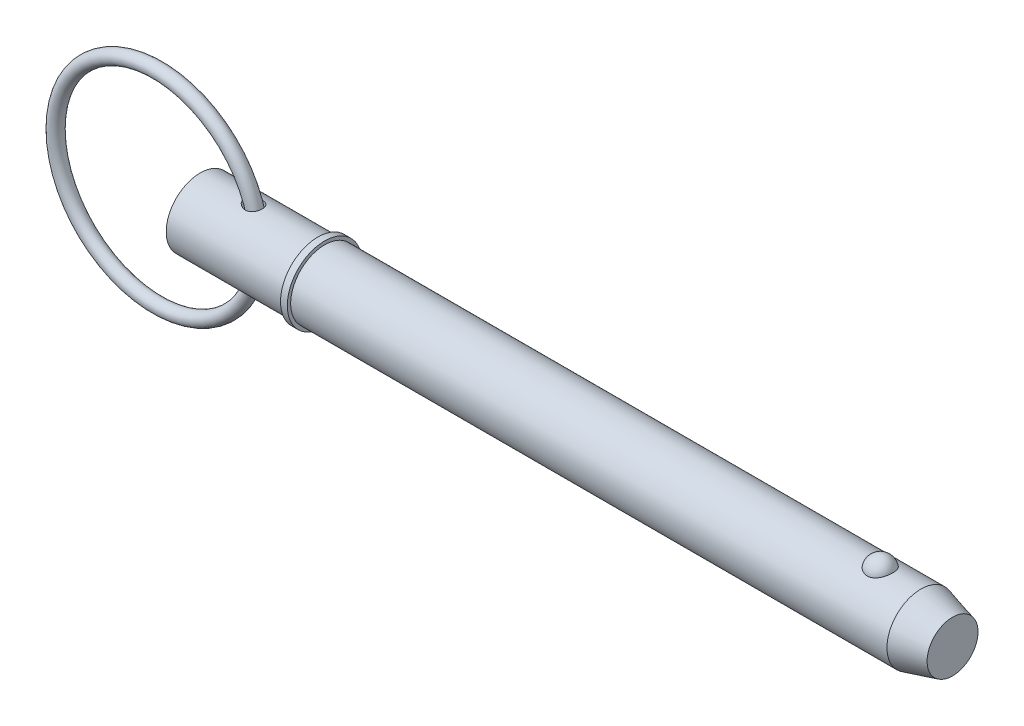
ISO-10303-21;
HEADER;
FILE_DESCRIPTION(('STEP AP214'),'2;1');
FILE_NAME('part.step','',(''),(''),'','','');
FILE_SCHEMA(('AUTOMOTIVE_DESIGN { 1 0 10303 214 1 1 1 1 }'));
ENDSEC;
DATA;
#1=APPLICATION_CONTEXT('core data for automotive mechanical design processes');
#2=APPLICATION_PROTOCOL_DEFINITION('international standard','automotive_design',2000,#1);
#3=PRODUCT_CONTEXT('',#1,'mechanical');
#4=PRODUCT('Part','Part','',(#3));
#5=PRODUCT_RELATED_PRODUCT_CATEGORY('part','',(#4));
#6=PRODUCT_DEFINITION_FORMATION('','',#4);
#7=PRODUCT_DEFINITION_CONTEXT('part definition',#1,'design');
#8=PRODUCT_DEFINITION('design','',#6,#7);
#9=PRODUCT_DEFINITION_SHAPE('','',#8);
#10=(LENGTH_UNIT() NAMED_UNIT(*) SI_UNIT(.MILLI.,.METRE.));
#11=(NAMED_UNIT(*) PLANE_ANGLE_UNIT() SI_UNIT($,.RADIAN.));
#12=(NAMED_UNIT(*) SI_UNIT($,.STERADIAN.) SOLID_ANGLE_UNIT());
#13=UNCERTAINTY_MEASURE_WITH_UNIT(LENGTH_MEASURE(1.E-05),#10,'distance_accuracy_value','');
#14=(GEOMETRIC_REPRESENTATION_CONTEXT(3) GLOBAL_UNCERTAINTY_ASSIGNED_CONTEXT((#13)) GLOBAL_UNIT_ASSIGNED_CONTEXT((#10,
#11,#12)) REPRESENTATION_CONTEXT('',''));
#15=CARTESIAN_POINT('',(0.,0.,0.));
#16=DIRECTION('',(0.,0.,1.));
#17=DIRECTION('',(1.,0.,0.));
#18=AXIS2_PLACEMENT_3D('',#15,#16,#17);
#19=CARTESIAN_POINT('',(-11.9894358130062,0.,0.));
#20=DIRECTION('',(0.,0.,1.));
#21=DIRECTION('',(1.,0.,0.));
#22=AXIS2_PLACEMENT_3D('',#19,#20,#21);
#23=TOROIDAL_SURFACE('',#22,28.575,1.905);
#24=CARTESIAN_POINT('',(18.4905641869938,0.,0.));
#25=VERTEX_POINT('',#24);
#26=VERTEX_LOOP('',#25);
#27=FACE_BOUND('',#26,.T.);
#28=ADVANCED_FACE('P0_F12',(#27),#23,.T.);
#29=CLOSED_SHELL('',(#28));
#30=MANIFOLD_SOLID_BREP('P0_B1',#29);
#31=CARTESIAN_POINT('',(0.,0.,0.));
#32=DIRECTION('',(1.,0.,0.));
#33=DIRECTION('',(0.,0.,-1.));
#34=AXIS2_PLACEMENT_3D('',#31,#32,#33);
#35=CYLINDRICAL_SURFACE('',#34,9.525);
#36=CARTESIAN_POINT('',(12.9513882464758,9.41921920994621,-1.41559473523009));
#37=CARTESIAN_POINT('',(13.0504692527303,9.40163924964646,-1.53256769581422));
#38=CARTESIAN_POINT('',(13.1602600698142,9.38319823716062,-1.6404459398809));
#39=CARTESIAN_POINT('',(13.3966485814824,9.34687220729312,-1.83618480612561));
#40=CARTESIAN_POINT('',(13.5232761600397,9.32898824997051,-1.92400906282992));
#41=CARTESIAN_POINT('',(13.78900694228,9.29593183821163,-2.07784697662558));
#42=CARTESIAN_POINT('',(13.9280753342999,9.28075215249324,-2.14391921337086));
#43=CARTESIAN_POINT('',(14.2153444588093,9.25488828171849,-2.25295850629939));
#44=CARTESIAN_POINT('',(14.3635415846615,9.24420233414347,-2.29593462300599));
#45=CARTESIAN_POINT('',(14.669669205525,9.22859713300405,-2.3579005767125));
#46=CARTESIAN_POINT('',(14.8277567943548,9.22385123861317,-2.37617053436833));
#47=CARTESIAN_POINT('',(15.1447573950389,9.22170813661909,-2.38448481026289));
#48=CARTESIAN_POINT('',(15.3036699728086,9.22430739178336,-2.3745427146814));
#49=CARTESIAN_POINT('',(15.6046561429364,9.2363636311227,-2.32717331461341));
#50=CARTESIAN_POINT('',(15.7470893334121,9.24528216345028,-2.29190131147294));
#51=CARTESIAN_POINT('',(16.0228763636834,9.26842607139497,-2.19642882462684));
#52=CARTESIAN_POINT('',(16.1562346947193,9.28264879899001,-2.1362407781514));
#53=CARTESIAN_POINT('',(16.3991522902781,9.31332263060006,-1.99805318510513));
#54=CARTESIAN_POINT('',(16.5097585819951,9.32951023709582,-1.92182839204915));
#55=CARTESIAN_POINT('',(16.7159974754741,9.36298467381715,-1.75147176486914));
#56=CARTESIAN_POINT('',(16.811631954,9.38027136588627,-1.65734217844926));
#57=CARTESIAN_POINT('',(16.9833240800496,9.41356881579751,-1.45618916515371));
#58=CARTESIAN_POINT('',(17.0597719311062,9.42959946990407,-1.34950141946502));
#59=CARTESIAN_POINT('',(17.1939538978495,9.45905380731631,-1.12462011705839));
#60=CARTESIAN_POINT('',(17.2516877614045,9.4724774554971,-1.00642640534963));
#61=CARTESIAN_POINT('',(17.3474400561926,9.49535683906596,-0.760990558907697));
#62=CARTESIAN_POINT('',(17.3853184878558,9.50478431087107,-0.633691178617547));
#63=CARTESIAN_POINT('',(17.4399027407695,9.51852575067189,-0.374363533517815));
#64=CARTESIAN_POINT('',(17.4566077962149,9.52283953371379,-0.242335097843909));
#65=CARTESIAN_POINT('',(17.4685150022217,9.52590431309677,0.0235692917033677));
#66=CARTESIAN_POINT('',(17.4635842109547,9.52462091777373,0.157451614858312));
#67=CARTESIAN_POINT('',(17.4320243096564,9.5165501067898,0.422467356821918));
#68=CARTESIAN_POINT('',(17.4053947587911,9.50976257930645,0.55360071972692));
#69=CARTESIAN_POINT('',(17.3310009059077,9.49140797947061,0.809490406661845));
#70=CARTESIAN_POINT('',(17.2832204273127,9.47983724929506,0.934241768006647));
#71=CARTESIAN_POINT('',(17.1676219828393,9.453180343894,1.1736825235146));
#72=CARTESIAN_POINT('',(17.0998044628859,9.43809424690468,1.28837214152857));
#73=CARTESIAN_POINT('',(16.9461013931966,9.40614962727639,1.50393386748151));
#74=CARTESIAN_POINT('',(16.8602910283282,9.38929862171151,1.6048606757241));
#75=CARTESIAN_POINT('',(16.6726759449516,9.35566510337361,1.79055313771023));
#76=CARTESIAN_POINT('',(16.5708731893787,9.33888258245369,1.87532077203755));
#77=CARTESIAN_POINT('',(16.3550631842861,9.30741331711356,2.02572386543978));
#78=CARTESIAN_POINT('',(16.2411701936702,9.29270956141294,2.09151983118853));
#79=CARTESIAN_POINT('',(16.0037488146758,9.26681293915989,2.20343355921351));
#80=CARTESIAN_POINT('',(15.8802207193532,9.25561996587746,2.24955191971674));
#81=CARTESIAN_POINT('',(15.6262451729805,9.23779438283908,2.32167613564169));
#82=CARTESIAN_POINT('',(15.4957570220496,9.23119272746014,2.34754561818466));
#83=CARTESIAN_POINT('',(15.2322153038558,9.22318493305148,2.37881082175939));
#84=CARTESIAN_POINT('',(15.0991611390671,9.22178001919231,2.38420171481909));
#85=CARTESIAN_POINT('',(14.8267609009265,9.22414647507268,2.37503099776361));
#86=CARTESIAN_POINT('',(14.6874545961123,9.22819578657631,2.35939810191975));
#87=CARTESIAN_POINT('',(14.412976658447,9.24129253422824,2.30756034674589));
#88=CARTESIAN_POINT('',(14.2778066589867,9.25034191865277,2.27134746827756));
#89=CARTESIAN_POINT('',(14.0027915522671,9.27334688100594,2.1756145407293));
#90=CARTESIAN_POINT('',(13.8635960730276,9.28766658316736,2.11431132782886));
#91=CARTESIAN_POINT('',(13.5969045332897,9.31925368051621,1.97041856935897));
#92=CARTESIAN_POINT('',(13.4694182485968,9.33652350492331,1.88781145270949));
#93=CARTESIAN_POINT('',(13.2243568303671,9.37286659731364,1.69844580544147));
#94=CARTESIAN_POINT('',(13.1075060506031,9.39198626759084,1.59075211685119));
#95=CARTESIAN_POINT('',(12.8957171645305,9.42881110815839,1.35544651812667));
#96=CARTESIAN_POINT('',(12.8007455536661,9.44651841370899,1.22786557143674));
#97=CARTESIAN_POINT('',(12.6580495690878,9.4741137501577,0.9887243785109));
#98=CARTESIAN_POINT('',(12.604453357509,9.4848570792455,0.880756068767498));
#99=CARTESIAN_POINT('',(12.515693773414,9.50295777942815,0.657225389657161));
#100=CARTESIAN_POINT('',(12.4805142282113,9.51031812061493,0.541669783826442));
#101=CARTESIAN_POINT('',(12.4305797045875,9.52083647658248,0.305475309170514));
#102=CARTESIAN_POINT('',(12.4159122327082,9.52397648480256,0.18481691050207));
#103=CARTESIAN_POINT('',(12.408320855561,9.52559626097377,-0.0572308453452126));
#104=CARTESIAN_POINT('',(12.4153963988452,9.52407614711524,-0.178620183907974));
#105=CARTESIAN_POINT('',(12.4495068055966,9.51684301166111,-0.409566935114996));
#106=CARTESIAN_POINT('',(12.4750931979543,9.51143444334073,-0.519353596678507));
#107=CARTESIAN_POINT('',(12.543120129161,9.49733710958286,-0.73328523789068));
#108=CARTESIAN_POINT('',(12.5855568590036,9.4886490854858,-0.837431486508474));
#109=CARTESIAN_POINT('',(12.6780792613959,9.47023833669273,-1.02356028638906));
#110=CARTESIAN_POINT('',(12.7261842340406,9.46084463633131,-1.10657511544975));
#111=CARTESIAN_POINT('',(12.8319313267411,9.44081892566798,-1.26610577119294));
#112=CARTESIAN_POINT('',(12.8895756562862,9.43018662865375,-1.34262008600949));
#113=CARTESIAN_POINT('',(12.9513882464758,9.41921920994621,-1.41559473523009));
#114=B_SPLINE_CURVE_WITH_KNOTS('',3,(#36,#37,#38,#39,#40,#41,#42,#43,#44,#45,#46,#47,#48,#49,
#50,#51,#52,#53,#54,#55,#56,#57,#58,#59,#60,#61,#62,#63,#64,#65,#66,#67,#68,#69,#70,#71,#72,#73,
#74,#75,#76,#77,#78,#79,#80,#81,#82,#83,#84,#85,#86,#87,#88,#89,#90,#91,#92,#93,#94,#95,#96,#97,
#98,#99,#100,#101,#102,#103,#104,#105,#106,#107,#108,#109,#110,#111,#112,#113),.UNSPECIFIED.,
.T.,.F.,(4,2,2,2,2,2,2,2,2,2,2,2,2,2,2,2,2,2,2,2,2,2,2,2,2,2,2,2,2,2,2,2,2,2,2,2,2,2,4),(0.,
0.462524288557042,0.925880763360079,1.3879789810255,1.8498957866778,2.3250010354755,
2.79987752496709,3.23851602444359,3.67693583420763,4.08084875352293,4.48471100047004,
4.87953549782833,5.27436531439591,5.67194282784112,6.0695347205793,6.46957303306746,
6.86961947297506,7.26997240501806,7.67031642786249,8.06901977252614,8.46767421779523,
8.86284969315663,9.25801315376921,9.65581560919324,10.0537118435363,10.4726706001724,
10.8917927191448,11.3481090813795,11.8048030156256,12.2824769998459,12.7594145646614,
13.1209614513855,13.4821903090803,13.8449555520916,14.2077115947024,14.5447865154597,
14.881785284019,15.170268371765,15.4588183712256),.UNSPECIFIED.);
#115=CARTESIAN_POINT('',(12.9513882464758,9.41921920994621,-1.41559473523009));
#116=VERTEX_POINT('',#115);
#117=EDGE_CURVE('P1_E42',#116,#116,#114,.T.);
#118=ORIENTED_EDGE('',*,*,#117,.T.);
#119=EDGE_LOOP('',(#118));
#120=FACE_BOUND('',#119,.T.);
#121=CARTESIAN_POINT('',(0.,0.,0.));
#122=DIRECTION('',(1.,0.,0.));
#123=DIRECTION('',(0.,0.,-1.));
#124=AXIS2_PLACEMENT_3D('',#121,#122,#123);
#125=CIRCLE('',#124,9.525);
#126=CARTESIAN_POINT('',(0.,0.,-9.525));
#127=VERTEX_POINT('',#126);
#128=EDGE_CURVE('P1_E9',#127,#127,#125,.T.);
#129=ORIENTED_EDGE('',*,*,#128,.T.);
#130=EDGE_LOOP('',(#129));
#131=FACE_BOUND('',#130,.T.);
#132=CARTESIAN_POINT('',(33.025,0.,0.));
#133=DIRECTION('',(1.,0.,0.));
#134=DIRECTION('',(0.,0.,-1.));
#135=AXIS2_PLACEMENT_3D('',#132,#133,#134);
#136=CIRCLE('',#135,9.525);
#137=CARTESIAN_POINT('',(33.025,0.,-9.525));
#138=VERTEX_POINT('',#137);
#139=EDGE_CURVE('P1_E25',#138,#138,#136,.T.);
#140=ORIENTED_EDGE('',*,*,#139,.F.);
#141=EDGE_LOOP('',(#140));
#142=FACE_BOUND('',#141,.T.);
#143=CARTESIAN_POINT('',(12.9513882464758,-9.41921920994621,-1.41559473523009));
#144=CARTESIAN_POINT('',(12.8706569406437,-9.43354320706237,-1.32028288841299));
#145=CARTESIAN_POINT('',(12.7970077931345,-9.44729974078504,-1.21890449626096));
#146=CARTESIAN_POINT('',(12.6667099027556,-9.47239055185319,-1.00546491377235));
#147=CARTESIAN_POINT('',(12.6100480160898,-9.48372669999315,-0.893412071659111));
#148=CARTESIAN_POINT('',(12.5163428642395,-9.50281544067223,-0.66020233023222));
#149=CARTESIAN_POINT('',(12.4794216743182,-9.51054569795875,-0.538993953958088));
#150=CARTESIAN_POINT('',(12.4282252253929,-9.52133525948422,-0.29167282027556));
#151=CARTESIAN_POINT('',(12.4139371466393,-9.52439720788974,-0.165562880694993));
#152=CARTESIAN_POINT('',(12.4092595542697,-9.52539668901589,0.0763263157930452));
#153=CARTESIAN_POINT('',(12.4169377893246,-9.5237485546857,0.192070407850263));
#154=CARTESIAN_POINT('',(12.4515961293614,-9.51640070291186,0.420478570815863));
#155=CARTESIAN_POINT('',(12.4785770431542,-9.51070081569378,0.533142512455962));
#156=CARTESIAN_POINT('',(12.5496371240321,-9.49599978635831,0.750537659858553));
#157=CARTESIAN_POINT('',(12.5934215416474,-9.48705569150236,0.855370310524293));
#158=CARTESIAN_POINT('',(12.6960201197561,-9.46670226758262,1.05710432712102));
#159=CARTESIAN_POINT('',(12.754838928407,-9.45529217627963,1.15400322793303));
#160=CARTESIAN_POINT('',(12.8926588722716,-9.42958102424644,1.34883014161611));
#161=CARTESIAN_POINT('',(12.9731843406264,-9.41509922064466,1.44565277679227));
#162=CARTESIAN_POINT('',(13.1473692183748,-9.38554264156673,1.62653953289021));
#163=CARTESIAN_POINT('',(13.2410364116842,-9.37046751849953,1.71059603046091));
#164=CARTESIAN_POINT('',(13.4543924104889,-9.33867330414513,1.87697964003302));
#165=CARTESIAN_POINT('',(13.5758667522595,-9.32205896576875,1.95704323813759));
#166=CARTESIAN_POINT('',(13.8299208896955,-9.29140277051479,2.09777392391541));
#167=CARTESIAN_POINT('',(13.9625074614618,-9.27736250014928,2.15842906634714));
#168=CARTESIAN_POINT('',(14.2477938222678,-9.25234849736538,2.26337318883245));
#169=CARTESIAN_POINT('',(14.4012368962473,-9.2417532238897,2.30575283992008));
#170=CARTESIAN_POINT('',(14.7134258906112,-9.22706044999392,2.36387471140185));
#171=CARTESIAN_POINT('',(14.8721705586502,-9.22296142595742,2.37962317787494));
#172=CARTESIAN_POINT('',(15.1841930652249,-9.22219798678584,2.38258156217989));
#173=CARTESIAN_POINT('',(15.3374581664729,-9.22526675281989,2.37081567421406));
#174=CARTESIAN_POINT('',(15.6390558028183,-9.23821642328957,2.31984408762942));
#175=CARTESIAN_POINT('',(15.7873916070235,-9.24809271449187,2.28065697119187));
#176=CARTESIAN_POINT('',(16.0605055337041,-9.27231045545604,2.17997072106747));
#177=CARTESIAN_POINT('',(16.1861988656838,-9.28616347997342,2.12082794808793));
#178=CARTESIAN_POINT('',(16.4248737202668,-9.31689725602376,1.9814435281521));
#179=CARTESIAN_POINT('',(16.5378583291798,-9.33377726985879,1.90120701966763));
#180=CARTESIAN_POINT('',(16.7424913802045,-9.36766057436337,1.72629138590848));
#181=CARTESIAN_POINT('',(16.8349077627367,-9.38461836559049,1.63249912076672));
#182=CARTESIAN_POINT('',(17.0025959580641,-9.41752009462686,1.43052052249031));
#183=CARTESIAN_POINT('',(17.0778684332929,-9.43346407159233,1.32233474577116));
#184=CARTESIAN_POINT('',(17.2093311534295,-9.46256896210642,1.09477833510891));
#185=CARTESIAN_POINT('',(17.2655443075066,-9.47573320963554,0.975421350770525));
#186=CARTESIAN_POINT('',(17.3577240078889,-9.49788660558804,0.728764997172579));
#187=CARTESIAN_POINT('',(17.3936897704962,-9.5068755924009,0.601465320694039));
#188=CARTESIAN_POINT('',(17.4447894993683,-9.51977728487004,0.341392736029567));
#189=CARTESIAN_POINT('',(17.4597470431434,-9.52364698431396,0.208583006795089));
#190=CARTESIAN_POINT('',(17.467935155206,-9.52575588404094,-0.0577507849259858));
#191=CARTESIAN_POINT('',(17.4611651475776,-9.52399493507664,-0.191274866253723));
#192=CARTESIAN_POINT('',(17.4259933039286,-9.51501704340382,-0.455658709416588));
#193=CARTESIAN_POINT('',(17.3975278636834,-9.50778405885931,-0.586509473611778));
#194=CARTESIAN_POINT('',(17.3195245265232,-9.48862442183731,-0.841413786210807));
#195=CARTESIAN_POINT('',(17.2699864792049,-9.47669773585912,-0.965467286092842));
#196=CARTESIAN_POINT('',(17.1510794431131,-9.44947793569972,-1.20302860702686));
#197=CARTESIAN_POINT('',(17.0817421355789,-9.43419020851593,-1.31655289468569));
#198=CARTESIAN_POINT('',(16.9249035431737,-9.40193593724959,-1.52999797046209));
#199=CARTESIAN_POINT('',(16.8374037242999,-9.38496952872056,-1.62991985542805));
#200=CARTESIAN_POINT('',(16.6472525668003,-9.35139745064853,-1.81261591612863));
#201=CARTESIAN_POINT('',(16.544718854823,-9.33479003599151,-1.89551219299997));
#202=CARTESIAN_POINT('',(16.3268885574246,-9.30366076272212,-2.04284430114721));
#203=CARTESIAN_POINT('',(16.2115933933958,-9.28913867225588,-2.10728218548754));
#204=CARTESIAN_POINT('',(15.9721327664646,-9.26380878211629,-2.21598517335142));
#205=CARTESIAN_POINT('',(15.8480095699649,-9.25298455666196,-2.26033977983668));
#206=CARTESIAN_POINT('',(15.5939970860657,-9.23601616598,-2.32870721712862));
#207=CARTESIAN_POINT('',(15.4641070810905,-9.22987258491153,-2.35271750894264));
#208=CARTESIAN_POINT('',(15.1982340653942,-9.22261892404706,-2.38099747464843));
#209=CARTESIAN_POINT('',(15.0621840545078,-9.22166165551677,-2.38466791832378));
#210=CARTESIAN_POINT('',(14.7911713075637,-9.22504733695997,-2.37153091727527));
#211=CARTESIAN_POINT('',(14.6562088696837,-9.2293916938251,-2.35471803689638));
#212=CARTESIAN_POINT('',(14.3799999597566,-9.24325361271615,-2.29972931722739));
#213=CARTESIAN_POINT('',(14.2390842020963,-9.25314817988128,-2.2599897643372));
#214=CARTESIAN_POINT('',(13.9651910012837,-9.27709186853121,-2.15959208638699));
#215=CARTESIAN_POINT('',(13.8322212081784,-9.29114491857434,-2.09891417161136));
#216=CARTESIAN_POINT('',(13.5621642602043,-9.32369066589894,-1.94960068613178));
#217=CARTESIAN_POINT('',(13.4264724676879,-9.34251276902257,-1.85849626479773));
#218=CARTESIAN_POINT('',(13.1736579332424,-9.38095091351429,-1.6535412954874));
#219=CARTESIAN_POINT('',(13.0565182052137,-9.40056620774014,-1.53971177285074));
#220=CARTESIAN_POINT('',(12.9513882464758,-9.41921920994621,-1.41559473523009));
#221=B_SPLINE_CURVE_WITH_KNOTS('',3,(#143,#144,#145,#146,#147,#148,#149,#150,#151,#152,#153,
#154,#155,#156,#157,#158,#159,#160,#161,#162,#163,#164,#165,#166,#167,#168,#169,#170,#171,#172,
#173,#174,#175,#176,#177,#178,#179,#180,#181,#182,#183,#184,#185,#186,#187,#188,#189,#190,#191,
#192,#193,#194,#195,#196,#197,#198,#199,#200,#201,#202,#203,#204,#205,#206,#207,#208,#209,#210,
#211,#212,#213,#214,#215,#216,#217,#218,#219,#220),.UNSPECIFIED.,.T.,.F.,(4,2,2,2,2,2,2,2,2,2,2,
2,2,2,2,2,2,2,2,2,2,2,2,2,2,2,2,2,2,2,2,2,2,2,2,2,2,2,4),(0.,0.376746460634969,0.75320065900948,
1.13195666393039,1.51049805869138,1.85679105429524,2.20309856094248,2.54359033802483,
2.88418751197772,3.26301611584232,3.64207005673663,4.07954912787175,4.51729693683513,
4.99355673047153,5.46970480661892,5.92841231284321,6.38680927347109,6.80346940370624,
7.22002812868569,7.61642768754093,8.01281192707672,8.40871801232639,8.80463942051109,
9.20386620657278,9.60310357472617,10.0035159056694,10.4039310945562,10.8037091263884,
11.2034549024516,11.6002252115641,11.9969513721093,12.3918916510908,12.7868812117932,
13.1934480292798,13.6001227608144,14.038511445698,14.4773156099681,14.9683748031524,
15.4589817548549),.UNSPECIFIED.);
#222=CARTESIAN_POINT('',(12.9513882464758,-9.41921920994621,-1.41559473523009));
#223=VERTEX_POINT('',#222);
#224=EDGE_CURVE('P1_E17',#223,#223,#221,.T.);
#225=ORIENTED_EDGE('',*,*,#224,.T.);
#226=EDGE_LOOP('',(#225));
#227=FACE_BOUND('',#226,.T.);
#228=ADVANCED_FACE('P1_F13',(#120,#131,#142,#227),#35,.T.);
#229=CARTESIAN_POINT('',(0.,0.,0.));
#230=DIRECTION('',(1.,0.,0.));
#231=DIRECTION('',(0.,0.,-1.));
#232=AXIS2_PLACEMENT_3D('',#229,#230,#231);
#233=CYLINDRICAL_SURFACE('',#232,9.525);
#234=CARTESIAN_POINT('',(202.243054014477,0.,0.));
#235=DIRECTION('',(1.,0.,0.));
#236=DIRECTION('',(0.,0.,-1.));
#237=AXIS2_PLACEMENT_3D('',#234,#235,#236);
#238=CIRCLE('',#237,9.525);
#239=CARTESIAN_POINT('',(202.243054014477,0.,-9.525));
#240=VERTEX_POINT('',#239);
#241=EDGE_CURVE('P1_E99',#240,#240,#238,.T.);
#242=ORIENTED_EDGE('',*,*,#241,.F.);
#243=EDGE_LOOP('',(#242));
#244=FACE_BOUND('',#243,.T.);
#245=CARTESIAN_POINT('',(34.93,0.,0.));
#246=DIRECTION('',(1.,0.,0.));
#247=DIRECTION('',(0.,0.,-1.));
#248=AXIS2_PLACEMENT_3D('',#245,#246,#247);
#249=CIRCLE('',#248,9.525);
#250=CARTESIAN_POINT('',(34.93,0.,-9.525));
#251=VERTEX_POINT('',#250);
#252=EDGE_CURVE('P1_E96',#251,#251,#249,.T.);
#253=ORIENTED_EDGE('',*,*,#252,.T.);
#254=EDGE_LOOP('',(#253));
#255=FACE_BOUND('',#254,.T.);
#256=CARTESIAN_POINT('',(190.845757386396,8.80405803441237,3.63513233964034));
#257=CARTESIAN_POINT('',(190.751676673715,8.80405953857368,3.63513053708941));
#258=CARTESIAN_POINT('',(190.657561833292,8.80561325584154,3.63137461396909));
#259=CARTESIAN_POINT('',(190.470012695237,8.81177748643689,3.61638665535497));
#260=CARTESIAN_POINT('',(190.376578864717,8.81638992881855,3.60514990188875));
#261=CARTESIAN_POINT('',(190.097945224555,8.83467114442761,3.56024627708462));
#262=CARTESIAN_POINT('',(189.914691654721,8.85278327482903,3.51538626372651));
#263=CARTESIAN_POINT('',(189.559509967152,8.89871214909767,3.39742145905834));
#264=CARTESIAN_POINT('',(189.387553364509,8.92650327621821,3.32439116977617));
#265=CARTESIAN_POINT('',(189.058707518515,8.98874819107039,3.15220244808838));
#266=CARTESIAN_POINT('',(188.901811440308,9.02319893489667,3.05305594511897));
#267=CARTESIAN_POINT('',(188.602214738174,9.09629186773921,2.82797815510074));
#268=CARTESIAN_POINT('',(188.460060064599,9.13502685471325,2.70135138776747));
#269=CARTESIAN_POINT('',(188.198299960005,9.21186572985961,2.42641932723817));
#270=CARTESIAN_POINT('',(188.078701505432,9.24996941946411,2.27810735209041));
#271=CARTESIAN_POINT('',(187.859645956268,9.32341082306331,1.95652290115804));
#272=CARTESIAN_POINT('',(187.761317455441,9.35855090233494,1.78243511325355));
#273=CARTESIAN_POINT('',(187.593819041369,9.42045142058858,1.419372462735));
#274=CARTESIAN_POINT('',(187.524651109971,9.44721128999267,1.23039658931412));
#275=CARTESIAN_POINT('',(187.416199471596,9.48990641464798,0.840370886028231));
#276=CARTESIAN_POINT('',(187.377288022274,9.50570658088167,0.639202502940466));
#277=CARTESIAN_POINT('',(187.331555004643,9.52433146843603,0.232664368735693));
#278=CARTESIAN_POINT('',(187.324732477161,9.52715657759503,0.0272947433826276));
#279=CARTESIAN_POINT('',(187.343255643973,9.51956918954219,-0.380478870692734));
#280=CARTESIAN_POINT('',(187.368405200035,9.50923740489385,-0.582893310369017));
#281=CARTESIAN_POINT('',(187.45002537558,9.47651897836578,-0.980293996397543));
#282=CARTESIAN_POINT('',(187.506496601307,9.45413210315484,-1.17528009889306));
#283=CARTESIAN_POINT('',(187.649719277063,9.39954044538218,-1.55263697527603));
#284=CARTESIAN_POINT('',(187.736512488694,9.36732213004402,-1.73498993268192));
#285=CARTESIAN_POINT('',(187.938610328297,9.29640700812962,-2.08177763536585));
#286=CARTESIAN_POINT('',(188.053917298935,9.25770966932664,-2.24621090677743));
#287=CARTESIAN_POINT('',(188.311264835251,9.17775604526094,-2.55338333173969));
#288=CARTESIAN_POINT('',(188.453434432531,9.136488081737,-2.69601150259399));
#289=CARTESIAN_POINT('',(188.76089985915,9.05620497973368,-2.95451229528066));
#290=CARTESIAN_POINT('',(188.926193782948,9.01718965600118,-3.070387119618));
#291=CARTESIAN_POINT('',(189.272052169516,8.94680019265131,-3.26976836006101));
#292=CARTESIAN_POINT('',(189.452227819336,8.91528408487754,-3.35389750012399));
#293=CARTESIAN_POINT('',(189.825651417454,8.86272514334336,-3.49043503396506));
#294=CARTESIAN_POINT('',(190.018894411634,8.84167836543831,-3.54285537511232));
#295=CARTESIAN_POINT('',(190.402503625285,8.81348056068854,-3.61241306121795));
#296=CARTESIAN_POINT('',(190.592525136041,8.80568348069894,-3.6311933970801));
#297=CARTESIAN_POINT('',(190.973190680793,8.80289410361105,-3.63795342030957));
#298=CARTESIAN_POINT('',(191.163834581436,8.80789922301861,-3.62593932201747));
#299=CARTESIAN_POINT('',(191.534007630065,8.82974915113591,-3.57238430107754));
#300=CARTESIAN_POINT('',(191.713697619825,8.84621463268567,-3.53178890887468));
#301=CARTESIAN_POINT('',(192.063422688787,8.88875330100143,-3.42331083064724));
#302=CARTESIAN_POINT('',(192.233456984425,8.91482726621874,-3.35542593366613));
#303=CARTESIAN_POINT('',(192.563237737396,8.97448239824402,-3.19248225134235));
#304=CARTESIAN_POINT('',(192.722680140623,9.00821446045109,-3.09686474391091));
#305=CARTESIAN_POINT('',(193.023513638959,9.07935398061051,-2.88162736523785));
#306=CARTESIAN_POINT('',(193.164900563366,9.11676228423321,-2.76200196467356));
#307=CARTESIAN_POINT('',(193.43331931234,9.19347419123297,-2.49516285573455));
#308=CARTESIAN_POINT('',(193.559275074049,9.23277872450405,-2.34686614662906));
#309=CARTESIAN_POINT('',(193.785522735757,9.3073761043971,-2.0309368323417));
#310=CARTESIAN_POINT('',(193.88581004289,9.34266823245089,-1.86330077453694));
#311=CARTESIAN_POINT('',(194.061514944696,9.40674710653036,-1.50744893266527));
#312=CARTESIAN_POINT('',(194.136041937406,9.43529176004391,-1.31874876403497));
#313=CARTESIAN_POINT('',(194.25416505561,9.48144132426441,-0.930631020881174));
#314=CARTESIAN_POINT('',(194.297760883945,9.49904612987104,-0.731213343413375));
#315=CARTESIAN_POINT('',(194.353158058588,9.5215314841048,-0.327147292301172));
#316=CARTESIAN_POINT('',(194.364935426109,9.52640243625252,-0.122495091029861));
#317=CARTESIAN_POINT('',(194.356382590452,9.5228957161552,0.28601848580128));
#318=CARTESIAN_POINT('',(194.33605305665,9.5145183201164,0.489879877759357));
#319=CARTESIAN_POINT('',(194.263884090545,9.48544083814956,0.889994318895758));
#320=CARTESIAN_POINT('',(194.212199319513,9.46480124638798,1.08627971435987));
#321=CARTESIAN_POINT('',(194.078491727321,9.4133389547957,1.46682086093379));
#322=CARTESIAN_POINT('',(193.996466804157,9.38251554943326,1.65107577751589));
#323=CARTESIAN_POINT('',(193.80319292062,9.31365636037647,2.00346348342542));
#324=CARTESIAN_POINT('',(193.691783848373,9.27558138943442,2.17150083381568));
#325=CARTESIAN_POINT('',(193.442294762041,9.19638714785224,2.48563115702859));
#326=CARTESIAN_POINT('',(193.304216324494,9.15526805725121,2.63172542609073));
#327=CARTESIAN_POINT('',(193.004843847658,9.07465393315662,2.89750997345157));
#328=CARTESIAN_POINT('',(192.843610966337,9.03515496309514,3.01726776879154));
#329=CARTESIAN_POINT('',(192.501613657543,8.96227564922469,3.22732920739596));
#330=CARTESIAN_POINT('',(192.320841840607,8.92889763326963,3.31762165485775));
#331=CARTESIAN_POINT('',(191.951445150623,8.8734538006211,3.46314419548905));
#332=CARTESIAN_POINT('',(191.76332371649,8.85102983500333,3.51950082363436));
#333=CARTESIAN_POINT('',(191.47578699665,8.8266696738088,3.57993683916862));
#334=CARTESIAN_POINT('',(191.379133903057,8.82009725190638,3.5960621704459));
#335=CARTESIAN_POINT('',(191.184677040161,8.81020897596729,3.62022512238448));
#336=CARTESIAN_POINT('',(191.086874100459,8.80689090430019,3.62826825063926));
#337=CARTESIAN_POINT('',(190.941224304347,8.80445615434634,3.63416760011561));
#338=CARTESIAN_POINT('',(190.893495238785,8.80405727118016,3.63513325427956));
#339=CARTESIAN_POINT('',(190.845757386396,8.80405803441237,3.63513233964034));
#340=B_SPLINE_CURVE_WITH_KNOTS('',3,(#256,#257,#258,#259,#260,#261,#262,#263,#264,#265,#266,
#267,#268,#269,#270,#271,#272,#273,#274,#275,#276,#277,#278,#279,#280,#281,#282,#283,#284,#285,
#286,#287,#288,#289,#290,#291,#292,#293,#294,#295,#296,#297,#298,#299,#300,#301,#302,#303,#304,
#305,#306,#307,#308,#309,#310,#311,#312,#313,#314,#315,#316,#317,#318,#319,#320,#321,#322,#323,
#324,#325,#326,#327,#328,#329,#330,#331,#332,#333,#334,#335,#336,#337,#338,#339),.UNSPECIFIED.,
.T.,.F.,(4,2,2,2,2,2,2,2,2,2,2,2,2,2,2,2,2,2,2,2,2,2,2,2,2,2,2,2,2,2,2,2,2,2,2,2,2,2,2,2,2,4),
(0.,0.282202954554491,0.564584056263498,1.13017050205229,1.69427128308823,2.25811483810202,
2.83836627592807,3.41879688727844,4.02497117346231,4.63118665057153,5.24474754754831,
5.85829010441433,6.46808687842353,7.07789545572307,7.6885472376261,8.299249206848,
8.91296283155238,9.52662591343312,10.1275338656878,10.7282152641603,11.2986646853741,
11.8689989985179,12.4213015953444,12.973648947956,13.5380053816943,14.1024919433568,
14.695298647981,15.2882113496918,15.8999469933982,16.5116885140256,17.1238909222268,
17.7360805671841,18.3452748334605,18.9545113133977,19.567138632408,20.179729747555,
20.7907316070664,21.4019653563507,21.9915938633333,22.2859053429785,22.5800161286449,
22.7232098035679),.UNSPECIFIED.);
#341=CARTESIAN_POINT('',(190.845757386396,8.80405803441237,3.63513233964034));
#342=VERTEX_POINT('',#341);
#343=EDGE_CURVE('P1_E34',#342,#342,#340,.T.);
#344=ORIENTED_EDGE('',*,*,#343,.T.);
#345=EDGE_LOOP('',(#344));
#346=FACE_BOUND('',#345,.T.);
#347=ADVANCED_FACE('P1_F46',(#244,#255,#346),#233,.T.);
#348=CARTESIAN_POINT('',(0.,0.,0.));
#349=DIRECTION('',(-1.,0.,0.));
#350=DIRECTION('',(0.,0.,1.));
#351=AXIS2_PLACEMENT_3D('',#348,#349,#350);
#352=PLANE('',#351);
#353=ORIENTED_EDGE('',*,*,#128,.F.);
#354=EDGE_LOOP('',(#353));
#355=FACE_BOUND('',#354,.T.);
#356=ADVANCED_FACE('P1_F15',(#355),#352,.T.);
#357=CARTESIAN_POINT('',(33.025,9.525,0.));
#358=DIRECTION('',(-1.,0.,0.));
#359=DIRECTION('',(0.,0.,1.));
#360=AXIS2_PLACEMENT_3D('',#357,#358,#359);
#361=PLANE('',#360);
#362=ORIENTED_EDGE('',*,*,#139,.T.);
#363=EDGE_LOOP('',(#362));
#364=FACE_BOUND('',#363,.T.);
#365=CARTESIAN_POINT('',(33.025,0.,0.));
#366=DIRECTION('',(1.,0.,0.));
#367=DIRECTION('',(0.,0.,-1.));
#368=AXIS2_PLACEMENT_3D('',#365,#366,#367);
#369=CIRCLE('',#368,10.4775);
#370=CARTESIAN_POINT('',(33.025,0.,-10.4775));
#371=VERTEX_POINT('',#370);
#372=EDGE_CURVE('P1_E30',#371,#371,#369,.T.);
#373=ORIENTED_EDGE('',*,*,#372,.F.);
#374=EDGE_LOOP('',(#373));
#375=FACE_BOUND('',#374,.T.);
#376=ADVANCED_FACE('P1_F81',(#364,#375),#361,.T.);
#377=CARTESIAN_POINT('',(0.,0.,0.));
#378=DIRECTION('',(1.,0.,0.));
#379=DIRECTION('',(0.,0.,-1.));
#380=AXIS2_PLACEMENT_3D('',#377,#378,#379);
#381=CYLINDRICAL_SURFACE('',#380,10.4775);
#382=ORIENTED_EDGE('',*,*,#372,.T.);
#383=EDGE_LOOP('',(#382));
#384=FACE_BOUND('',#383,.T.);
#385=CARTESIAN_POINT('',(34.93,0.,0.));
#386=DIRECTION('',(1.,0.,0.));
#387=DIRECTION('',(0.,0.,-1.));
#388=AXIS2_PLACEMENT_3D('',#385,#386,#387);
#389=CIRCLE('',#388,10.4775);
#390=CARTESIAN_POINT('',(34.93,0.,-10.4775));
#391=VERTEX_POINT('',#390);
#392=EDGE_CURVE('P1_E95',#391,#391,#389,.T.);
#393=ORIENTED_EDGE('',*,*,#392,.F.);
#394=EDGE_LOOP('',(#393));
#395=FACE_BOUND('',#394,.T.);
#396=ADVANCED_FACE('P1_F68',(#384,#395),#381,.T.);
#397=CARTESIAN_POINT('',(34.93,10.4775,0.));
#398=DIRECTION('',(1.,0.,0.));
#399=DIRECTION('',(0.,0.,-1.));
#400=AXIS2_PLACEMENT_3D('',#397,#398,#399);
#401=PLANE('',#400);
#402=ORIENTED_EDGE('',*,*,#392,.T.);
#403=EDGE_LOOP('',(#402));
#404=FACE_BOUND('',#403,.T.);
#405=ORIENTED_EDGE('',*,*,#252,.F.);
#406=EDGE_LOOP('',(#405));
#407=FACE_BOUND('',#406,.T.);
#408=ADVANCED_FACE('P1_F62',(#404,#407),#401,.T.);
#409=CARTESIAN_POINT('',(211.13,0.,0.));
#410=DIRECTION('',(-1.,0.,0.));
#411=DIRECTION('',(0.,0.,1.));
#412=AXIS2_PLACEMENT_3D('',#409,#410,#411);
#413=CONICAL_SURFACE('',#412,7.14375000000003,0.26179938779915);
#414=ORIENTED_EDGE('',*,*,#241,.T.);
#415=EDGE_LOOP('',(#414));
#416=FACE_BOUND('',#415,.T.);
#417=CARTESIAN_POINT('',(211.13,0.,0.));
#418=DIRECTION('',(1.,0.,0.));
#419=DIRECTION('',(0.,0.,-1.));
#420=AXIS2_PLACEMENT_3D('',#417,#418,#419);
#421=CIRCLE('',#420,7.14375000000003);
#422=CARTESIAN_POINT('',(211.13,0.,-7.14375000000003));
#423=VERTEX_POINT('',#422);
#424=EDGE_CURVE('P1_E41',#423,#423,#421,.T.);
#425=ORIENTED_EDGE('',*,*,#424,.F.);
#426=EDGE_LOOP('',(#425));
#427=FACE_BOUND('',#426,.T.);
#428=ADVANCED_FACE('P1_F59',(#416,#427),#413,.T.);
#429=CARTESIAN_POINT('',(211.13,7.14375000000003,0.));
#430=DIRECTION('',(1.,0.,0.));
#431=DIRECTION('',(0.,0.,-1.));
#432=AXIS2_PLACEMENT_3D('',#429,#430,#431);
#433=PLANE('',#432);
#434=ORIENTED_EDGE('',*,*,#424,.T.);
#435=EDGE_LOOP('',(#434));
#436=FACE_BOUND('',#435,.T.);
#437=ADVANCED_FACE('P1_F55',(#436),#433,.T.);
#438=CARTESIAN_POINT('',(190.845757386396,8.5725,0.));
#439=DIRECTION('',(-1.,0.,0.));
#440=DIRECTION('',(0.,-1.,0.));
#441=AXIS2_PLACEMENT_3D('',#438,#439,#440);
#442=SPHERICAL_SURFACE('',#441,3.64249999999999);
#443=ORIENTED_EDGE('',*,*,#343,.F.);
#444=EDGE_LOOP('',(#443));
#445=FACE_BOUND('',#444,.T.);
#446=ADVANCED_FACE('P1_F50',(#445),#442,.T.);
#447=CARTESIAN_POINT('',(-11.9894358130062,0.,0.));
#448=DIRECTION('',(0.,0.,1.));
#449=DIRECTION('',(1.,0.,0.));
#450=AXIS2_PLACEMENT_3D('',#447,#448,#449);
#451=TOROIDAL_SURFACE('',#450,28.575,2.38125);
#452=ORIENTED_EDGE('',*,*,#224,.F.);
#453=EDGE_LOOP('',(#452));
#454=FACE_BOUND('',#453,.T.);
#455=ORIENTED_EDGE('',*,*,#117,.F.);
#456=EDGE_LOOP('',(#455));
#457=FACE_BOUND('',#456,.T.);
#458=ADVANCED_FACE('P1_F54',(#454,#457),#451,.F.);
#459=CLOSED_SHELL('',(#228,#347,#356,#376,#396,#408,#428,#437,#446,#458));
#460=MANIFOLD_SOLID_BREP('P1_B1',#459);
#461=ADVANCED_BREP_SHAPE_REPRESENTATION('',(#18,#30,#460),#14);
#462=SHAPE_DEFINITION_REPRESENTATION(#9,#461);
ENDSEC;
END-ISO-10303-21;
